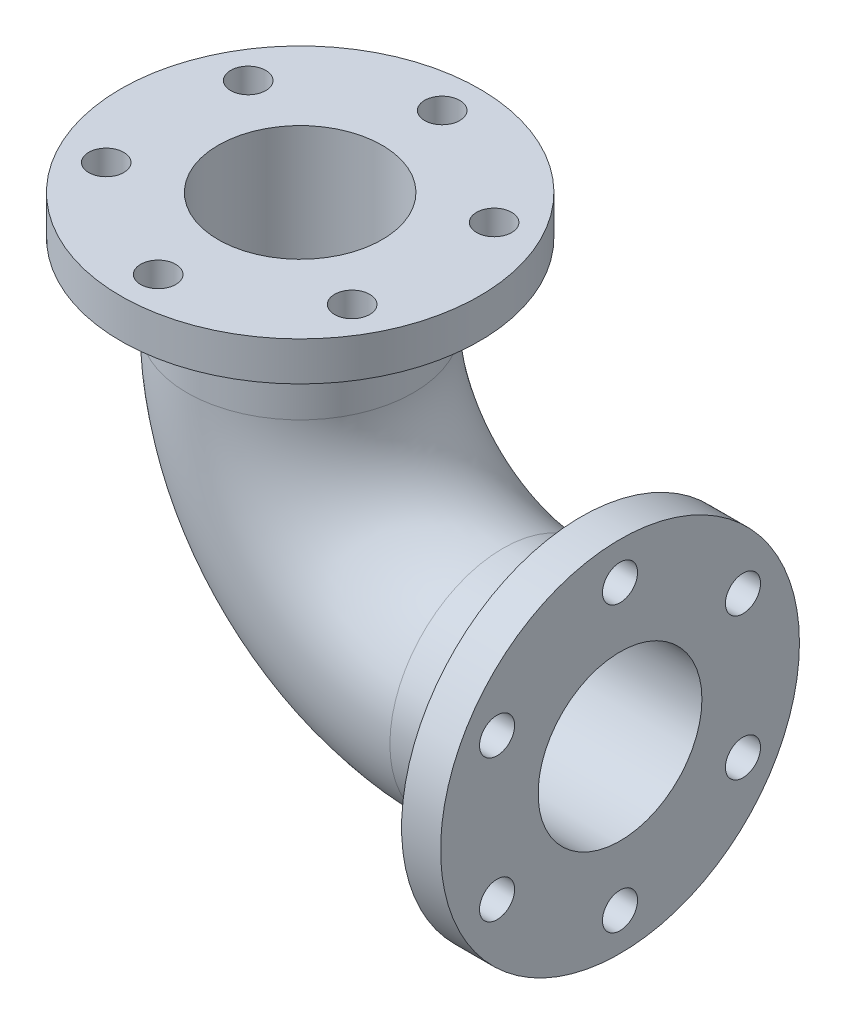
ISO-10303-21;
HEADER;
FILE_DESCRIPTION(('STEP AP214'),'2;1');
FILE_NAME('part.step','',(''),(''),'','','');
FILE_SCHEMA(('AUTOMOTIVE_DESIGN { 1 0 10303 214 1 1 1 1 }'));
ENDSEC;
DATA;
#1=APPLICATION_CONTEXT('core data for automotive mechanical design processes');
#2=APPLICATION_PROTOCOL_DEFINITION('international standard','automotive_design',2000,#1);
#3=PRODUCT_CONTEXT('',#1,'mechanical');
#4=PRODUCT('Part','Part','',(#3));
#5=PRODUCT_RELATED_PRODUCT_CATEGORY('part','',(#4));
#6=PRODUCT_DEFINITION_FORMATION('','',#4);
#7=PRODUCT_DEFINITION_CONTEXT('part definition',#1,'design');
#8=PRODUCT_DEFINITION('design','',#6,#7);
#9=PRODUCT_DEFINITION_SHAPE('','',#8);
#10=(LENGTH_UNIT() NAMED_UNIT(*) SI_UNIT(.MILLI.,.METRE.));
#11=(NAMED_UNIT(*) PLANE_ANGLE_UNIT() SI_UNIT($,.RADIAN.));
#12=(NAMED_UNIT(*) SI_UNIT($,.STERADIAN.) SOLID_ANGLE_UNIT());
#13=UNCERTAINTY_MEASURE_WITH_UNIT(LENGTH_MEASURE(1.E-05),#10,'distance_accuracy_value','');
#14=(GEOMETRIC_REPRESENTATION_CONTEXT(3) GLOBAL_UNCERTAINTY_ASSIGNED_CONTEXT((#13)) GLOBAL_UNIT_ASSIGNED_CONTEXT((#10,
#11,#12)) REPRESENTATION_CONTEXT('',''));
#15=CARTESIAN_POINT('',(0.,0.,0.));
#16=DIRECTION('',(0.,0.,1.));
#17=DIRECTION('',(1.,0.,0.));
#18=AXIS2_PLACEMENT_3D('',#15,#16,#17);
#19=CARTESIAN_POINT('',(0.,0.,0.));
#20=DIRECTION('',(0.,-1.,0.));
#21=DIRECTION('',(0.,0.,-1.));
#22=AXIS2_PLACEMENT_3D('',#19,#20,#21);
#23=CYLINDRICAL_SURFACE('',#22,145.);
#24=CARTESIAN_POINT('',(0.,-100.,0.));
#25=DIRECTION('',(0.,1.,0.));
#26=DIRECTION('',(0.,0.,1.));
#27=AXIS2_PLACEMENT_3D('',#24,#25,#26);
#28=CIRCLE('',#27,145.);
#29=CARTESIAN_POINT('',(-145.,-100.,0.));
#30=VERTEX_POINT('',#29);
#31=EDGE_CURVE('E56',#30,#30,#28,.T.);
#32=ORIENTED_EDGE('',*,*,#31,.T.);
#33=EDGE_LOOP('',(#32));
#34=FACE_BOUND('',#33,.T.);
#35=CARTESIAN_POINT('',(0.,0.,0.));
#36=DIRECTION('',(0.,1.,0.));
#37=DIRECTION('',(0.,0.,1.));
#38=AXIS2_PLACEMENT_3D('',#35,#36,#37);
#39=CIRCLE('',#38,145.);
#40=CARTESIAN_POINT('',(0.,0.,145.));
#41=VERTEX_POINT('',#40);
#42=EDGE_CURVE('E60',#41,#41,#39,.T.);
#43=ORIENTED_EDGE('',*,*,#42,.F.);
#44=EDGE_LOOP('',(#43));
#45=FACE_BOUND('',#44,.T.);
#46=ADVANCED_FACE('F48',(#34,#45),#23,.T.);
#47=CARTESIAN_POINT('',(260.,-100.,0.));
#48=DIRECTION('',(0.,0.,1.));
#49=DIRECTION('',(1.,0.,0.));
#50=AXIS2_PLACEMENT_3D('',#47,#48,#49);
#51=TOROIDAL_SURFACE('',#50,260.,145.);
#52=CARTESIAN_POINT('',(260.,-360.,0.));
#53=DIRECTION('',(-1.,0.,0.));
#54=DIRECTION('',(0.,0.,1.));
#55=AXIS2_PLACEMENT_3D('',#52,#53,#54);
#56=CIRCLE('',#55,145.);
#57=CARTESIAN_POINT('',(260.,-505.,0.));
#58=VERTEX_POINT('',#57);
#59=EDGE_CURVE('E11',#58,#58,#56,.T.);
#60=CARTESIAN_POINT('',(260.,-100.,0.));
#61=DIRECTION('',(0.,0.,1.));
#62=DIRECTION('',(1.,0.,0.));
#63=AXIS2_PLACEMENT_3D('',#60,#61,#62);
#64=CIRCLE('',#63,405.);
#65=EDGE_CURVE('',#30,#58,#64,.T.);
#66=ORIENTED_EDGE('',*,*,#31,.F.);
#67=ORIENTED_EDGE('',*,*,#59,.T.);
#68=ORIENTED_EDGE('',*,*,#65,.T.);
#69=ORIENTED_EDGE('',*,*,#65,.F.);
#70=EDGE_LOOP('',(#66,#68,#67,#69));
#71=FACE_BOUND('',#70,.T.);
#72=ADVANCED_FACE('F198',(#71),#51,.T.);
#73=CARTESIAN_POINT('',(260.,-360.,0.));
#74=DIRECTION('',(1.,0.,0.));
#75=DIRECTION('',(0.,1.,0.));
#76=AXIS2_PLACEMENT_3D('',#73,#74,#75);
#77=CYLINDRICAL_SURFACE('',#76,145.);
#78=CARTESIAN_POINT('',(360.,-360.,0.));
#79=DIRECTION('',(-1.,0.,0.));
#80=DIRECTION('',(0.,0.,1.));
#81=AXIS2_PLACEMENT_3D('',#78,#79,#80);
#82=CIRCLE('',#81,145.);
#83=CARTESIAN_POINT('',(360.,-360.,145.));
#84=VERTEX_POINT('',#83);
#85=EDGE_CURVE('E52',#84,#84,#82,.T.);
#86=ORIENTED_EDGE('',*,*,#85,.T.);
#87=EDGE_LOOP('',(#86));
#88=FACE_BOUND('',#87,.T.);
#89=ORIENTED_EDGE('',*,*,#59,.F.);
#90=EDGE_LOOP('',(#89));
#91=FACE_BOUND('',#90,.T.);
#92=ADVANCED_FACE('F50',(#88,#91),#77,.T.);
#93=CARTESIAN_POINT('',(0.,0.,0.));
#94=DIRECTION('',(0.,-1.,0.));
#95=DIRECTION('',(0.,0.,-1.));
#96=AXIS2_PLACEMENT_3D('',#93,#94,#95);
#97=CYLINDRICAL_SURFACE('',#96,105.);
#98=CARTESIAN_POINT('',(0.,-100.,0.));
#99=DIRECTION('',(0.,-1.,0.));
#100=DIRECTION('',(0.,0.,-1.));
#101=AXIS2_PLACEMENT_3D('',#98,#99,#100);
#102=CIRCLE('',#101,105.);
#103=CARTESIAN_POINT('',(-105.,-100.,0.));
#104=VERTEX_POINT('',#103);
#105=EDGE_CURVE('E68',#104,#104,#102,.F.);
#106=ORIENTED_EDGE('',*,*,#105,.F.);
#107=EDGE_LOOP('',(#106));
#108=FACE_BOUND('',#107,.T.);
#109=CARTESIAN_POINT('',(0.,50.,0.));
#110=DIRECTION('',(0.,1.,0.));
#111=DIRECTION('',(-1.,0.,0.));
#112=AXIS2_PLACEMENT_3D('',#109,#110,#111);
#113=CIRCLE('',#112,105.);
#114=CARTESIAN_POINT('',(-105.,50.,0.));
#115=VERTEX_POINT('',#114);
#116=EDGE_CURVE('E75',#115,#115,#113,.T.);
#117=ORIENTED_EDGE('',*,*,#116,.T.);
#118=EDGE_LOOP('',(#117));
#119=FACE_BOUND('',#118,.T.);
#120=ADVANCED_FACE('F193',(#108,#119),#97,.F.);
#121=CARTESIAN_POINT('',(260.,-100.,0.));
#122=DIRECTION('',(0.,0.,1.));
#123=DIRECTION('',(1.,0.,0.));
#124=AXIS2_PLACEMENT_3D('',#121,#122,#123);
#125=TOROIDAL_SURFACE('',#124,260.,105.);
#126=CARTESIAN_POINT('',(260.,-360.,0.));
#127=DIRECTION('',(-1.,0.,0.));
#128=DIRECTION('',(0.,-1.,0.));
#129=AXIS2_PLACEMENT_3D('',#126,#127,#128);
#130=CIRCLE('',#129,105.);
#131=CARTESIAN_POINT('',(260.,-465.,0.));
#132=VERTEX_POINT('',#131);
#133=EDGE_CURVE('E65',#132,#132,#130,.T.);
#134=CARTESIAN_POINT('',(260.,-100.,0.));
#135=DIRECTION('',(0.,0.,1.));
#136=DIRECTION('',(1.,0.,0.));
#137=AXIS2_PLACEMENT_3D('',#134,#135,#136);
#138=CIRCLE('',#137,365.);
#139=EDGE_CURVE('',#104,#132,#138,.T.);
#140=ORIENTED_EDGE('',*,*,#105,.T.);
#141=ORIENTED_EDGE('',*,*,#133,.F.);
#142=ORIENTED_EDGE('',*,*,#139,.T.);
#143=ORIENTED_EDGE('',*,*,#139,.F.);
#144=EDGE_LOOP('',(#140,#142,#141,#143));
#145=FACE_BOUND('',#144,.T.);
#146=ADVANCED_FACE('F183',(#145),#125,.F.);
#147=CARTESIAN_POINT('',(260.,-360.,0.));
#148=DIRECTION('',(1.,0.,0.));
#149=DIRECTION('',(0.,1.,0.));
#150=AXIS2_PLACEMENT_3D('',#147,#148,#149);
#151=CYLINDRICAL_SURFACE('',#150,105.);
#152=ORIENTED_EDGE('',*,*,#133,.T.);
#153=EDGE_LOOP('',(#152));
#154=FACE_BOUND('',#153,.T.);
#155=CARTESIAN_POINT('',(410.,-360.,0.));
#156=DIRECTION('',(1.,0.,0.));
#157=DIRECTION('',(0.,0.,-1.));
#158=AXIS2_PLACEMENT_3D('',#155,#156,#157);
#159=CIRCLE('',#158,105.);
#160=CARTESIAN_POINT('',(410.,-360.,-105.));
#161=VERTEX_POINT('',#160);
#162=EDGE_CURVE('E120',#161,#161,#159,.T.);
#163=ORIENTED_EDGE('',*,*,#162,.T.);
#164=EDGE_LOOP('',(#163));
#165=FACE_BOUND('',#164,.T.);
#166=ADVANCED_FACE('F180',(#154,#165),#151,.F.);
#167=CARTESIAN_POINT('',(0.,50.,0.));
#168=DIRECTION('',(0.,1.,0.));
#169=DIRECTION('',(-1.,0.,0.));
#170=AXIS2_PLACEMENT_3D('',#167,#168,#169);
#171=PLANE('',#170);
#172=CARTESIAN_POINT('',(157.616623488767,50.0000000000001,-91.0000000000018));
#173=DIRECTION('',(0.,1.,0.));
#174=DIRECTION('',(-0.50000000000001,0.,-0.866025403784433));
#175=AXIS2_PLACEMENT_3D('',#172,#173,#174);
#176=CIRCLE('',#175,22.5);
#177=CARTESIAN_POINT('',(146.366623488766,50.0000000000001,-110.485571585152));
#178=VERTEX_POINT('',#177);
#179=EDGE_CURVE('E97',#178,#178,#176,.T.);
#180=ORIENTED_EDGE('',*,*,#179,.F.);
#181=EDGE_LOOP('',(#180));
#182=FACE_BOUND('',#181,.T.);
#183=CARTESIAN_POINT('',(157.616623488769,50.0000000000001,90.9999999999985));
#184=DIRECTION('',(0.,1.,0.));
#185=DIRECTION('',(0.499999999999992,0.,-0.866025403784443));
#186=AXIS2_PLACEMENT_3D('',#183,#184,#185);
#187=CIRCLE('',#186,22.5);
#188=CARTESIAN_POINT('',(168.866623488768,50.0000000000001,71.5144284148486));
#189=VERTEX_POINT('',#188);
#190=EDGE_CURVE('E96',#189,#189,#187,.T.);
#191=ORIENTED_EDGE('',*,*,#190,.F.);
#192=EDGE_LOOP('',(#191));
#193=FACE_BOUND('',#192,.T.);
#194=CARTESIAN_POINT('',(0.,50.,182.));
#195=DIRECTION('',(0.,1.,0.));
#196=DIRECTION('',(1.,0.,0.));
#197=AXIS2_PLACEMENT_3D('',#194,#195,#196);
#198=CIRCLE('',#197,22.5);
#199=CARTESIAN_POINT('',(22.5,50.,182.));
#200=VERTEX_POINT('',#199);
#201=EDGE_CURVE('E103',#200,#200,#198,.T.);
#202=ORIENTED_EDGE('',*,*,#201,.F.);
#203=EDGE_LOOP('',(#202));
#204=FACE_BOUND('',#203,.T.);
#205=CARTESIAN_POINT('',(-157.616623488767,49.9999999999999,91.0000000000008));
#206=DIRECTION('',(0.,1.,0.));
#207=DIRECTION('',(0.500000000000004,0.,0.866025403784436));
#208=AXIS2_PLACEMENT_3D('',#205,#206,#207);
#209=CIRCLE('',#208,22.5);
#210=CARTESIAN_POINT('',(-146.366623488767,49.9999999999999,110.485571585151));
#211=VERTEX_POINT('',#210);
#212=EDGE_CURVE('E109',#211,#211,#209,.T.);
#213=ORIENTED_EDGE('',*,*,#212,.F.);
#214=EDGE_LOOP('',(#213));
#215=FACE_BOUND('',#214,.T.);
#216=CARTESIAN_POINT('',(-157.616623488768,49.9999999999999,-90.9999999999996));
#217=DIRECTION('',(0.,1.,0.));
#218=DIRECTION('',(-0.499999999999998,0.,0.86602540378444));
#219=AXIS2_PLACEMENT_3D('',#216,#217,#218);
#220=CIRCLE('',#219,22.5);
#221=CARTESIAN_POINT('',(-168.866623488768,49.9999999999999,-71.5144284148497));
#222=VERTEX_POINT('',#221);
#223=EDGE_CURVE('E89',#222,#222,#220,.T.);
#224=ORIENTED_EDGE('',*,*,#223,.F.);
#225=EDGE_LOOP('',(#224));
#226=FACE_BOUND('',#225,.T.);
#227=CARTESIAN_POINT('',(0.,50.,-182.));
#228=DIRECTION('',(0.,1.,0.));
#229=DIRECTION('',(-1.,0.,0.));
#230=AXIS2_PLACEMENT_3D('',#227,#228,#229);
#231=CIRCLE('',#230,22.5);
#232=CARTESIAN_POINT('',(-22.5,50.,-182.));
#233=VERTEX_POINT('',#232);
#234=EDGE_CURVE('E83',#233,#233,#231,.T.);
#235=ORIENTED_EDGE('',*,*,#234,.F.);
#236=EDGE_LOOP('',(#235));
#237=FACE_BOUND('',#236,.T.);
#238=CARTESIAN_POINT('',(0.,50.,0.));
#239=DIRECTION('',(0.,1.,0.));
#240=DIRECTION('',(-1.,0.,0.));
#241=AXIS2_PLACEMENT_3D('',#238,#239,#240);
#242=CIRCLE('',#241,230.);
#243=CARTESIAN_POINT('',(-230.,49.9999999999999,0.));
#244=VERTEX_POINT('',#243);
#245=EDGE_CURVE('E71',#244,#244,#242,.T.);
#246=ORIENTED_EDGE('',*,*,#245,.T.);
#247=EDGE_LOOP('',(#246));
#248=FACE_BOUND('',#247,.T.);
#249=ORIENTED_EDGE('',*,*,#116,.F.);
#250=EDGE_LOOP('',(#249));
#251=FACE_BOUND('',#250,.T.);
#252=ADVANCED_FACE('F182',(#182,#193,#204,#215,#226,#237,#248,#251),#171,.T.);
#253=CARTESIAN_POINT('',(0.,0.,0.));
#254=DIRECTION('',(0.,1.,0.));
#255=DIRECTION('',(-1.,0.,0.));
#256=AXIS2_PLACEMENT_3D('',#253,#254,#255);
#257=PLANE('',#256);
#258=CARTESIAN_POINT('',(157.616623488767,1.11022302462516E-13,-91.0000000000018));
#259=DIRECTION('',(0.,1.,0.));
#260=DIRECTION('',(-1.,0.,0.));
#261=AXIS2_PLACEMENT_3D('',#258,#259,#260);
#262=CIRCLE('',#261,22.5);
#263=CARTESIAN_POINT('',(135.116623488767,0.,-91.0000000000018));
#264=VERTEX_POINT('',#263);
#265=EDGE_CURVE('E93',#264,#264,#262,.F.);
#266=ORIENTED_EDGE('',*,*,#265,.F.);
#267=EDGE_LOOP('',(#266));
#268=FACE_BOUND('',#267,.T.);
#269=CARTESIAN_POINT('',(157.616623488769,1.11022302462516E-13,90.9999999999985));
#270=DIRECTION('',(0.,1.,0.));
#271=DIRECTION('',(-1.,0.,0.));
#272=AXIS2_PLACEMENT_3D('',#269,#270,#271);
#273=CIRCLE('',#272,22.5);
#274=CARTESIAN_POINT('',(135.116623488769,0.,90.9999999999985));
#275=VERTEX_POINT('',#274);
#276=EDGE_CURVE('E100',#275,#275,#273,.F.);
#277=ORIENTED_EDGE('',*,*,#276,.F.);
#278=EDGE_LOOP('',(#277));
#279=FACE_BOUND('',#278,.T.);
#280=CARTESIAN_POINT('',(0.,0.,182.));
#281=DIRECTION('',(0.,1.,0.));
#282=DIRECTION('',(-1.,0.,0.));
#283=AXIS2_PLACEMENT_3D('',#280,#281,#282);
#284=CIRCLE('',#283,22.5);
#285=CARTESIAN_POINT('',(-22.5,0.,182.));
#286=VERTEX_POINT('',#285);
#287=EDGE_CURVE('E106',#286,#286,#284,.F.);
#288=ORIENTED_EDGE('',*,*,#287,.F.);
#289=EDGE_LOOP('',(#288));
#290=FACE_BOUND('',#289,.T.);
#291=CARTESIAN_POINT('',(-157.616623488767,-1.11022302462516E-13,91.0000000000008));
#292=DIRECTION('',(0.,1.,0.));
#293=DIRECTION('',(-1.,0.,0.));
#294=AXIS2_PLACEMENT_3D('',#291,#292,#293);
#295=CIRCLE('',#294,22.5);
#296=CARTESIAN_POINT('',(-180.116623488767,-1.23512311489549E-13,91.0000000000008));
#297=VERTEX_POINT('',#296);
#298=EDGE_CURVE('E92',#297,#297,#295,.F.);
#299=ORIENTED_EDGE('',*,*,#298,.F.);
#300=EDGE_LOOP('',(#299));
#301=FACE_BOUND('',#300,.T.);
#302=CARTESIAN_POINT('',(-157.616623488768,-1.11022302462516E-13,-90.9999999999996));
#303=DIRECTION('',(0.,1.,0.));
#304=DIRECTION('',(-1.,0.,0.));
#305=AXIS2_PLACEMENT_3D('',#302,#303,#304);
#306=CIRCLE('',#305,22.5);
#307=CARTESIAN_POINT('',(-180.116623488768,-1.23512311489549E-13,-90.9999999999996));
#308=VERTEX_POINT('',#307);
#309=EDGE_CURVE('E86',#308,#308,#306,.F.);
#310=ORIENTED_EDGE('',*,*,#309,.F.);
#311=EDGE_LOOP('',(#310));
#312=FACE_BOUND('',#311,.T.);
#313=CARTESIAN_POINT('',(0.,0.,-182.));
#314=DIRECTION('',(0.,1.,0.));
#315=DIRECTION('',(-1.,0.,0.));
#316=AXIS2_PLACEMENT_3D('',#313,#314,#315);
#317=CIRCLE('',#316,22.5);
#318=CARTESIAN_POINT('',(-22.5,0.,-182.));
#319=VERTEX_POINT('',#318);
#320=EDGE_CURVE('E80',#319,#319,#317,.F.);
#321=ORIENTED_EDGE('',*,*,#320,.F.);
#322=EDGE_LOOP('',(#321));
#323=FACE_BOUND('',#322,.T.);
#324=ORIENTED_EDGE('',*,*,#42,.T.);
#325=EDGE_LOOP('',(#324));
#326=FACE_BOUND('',#325,.T.);
#327=CARTESIAN_POINT('',(0.,0.,0.));
#328=DIRECTION('',(0.,1.,0.));
#329=DIRECTION('',(-1.,0.,0.));
#330=AXIS2_PLACEMENT_3D('',#327,#328,#329);
#331=CIRCLE('',#330,230.);
#332=CARTESIAN_POINT('',(-230.,-1.27675647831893E-13,0.));
#333=VERTEX_POINT('',#332);
#334=EDGE_CURVE('E72',#333,#333,#331,.T.);
#335=ORIENTED_EDGE('',*,*,#334,.F.);
#336=EDGE_LOOP('',(#335));
#337=FACE_BOUND('',#336,.T.);
#338=ADVANCED_FACE('F190',(#268,#279,#290,#301,#312,#323,#326,#337),#257,.F.);
#339=CARTESIAN_POINT('',(0.,50.,0.));
#340=DIRECTION('',(0.,-1.,0.));
#341=DIRECTION('',(1.,0.,0.));
#342=AXIS2_PLACEMENT_3D('',#339,#340,#341);
#343=CYLINDRICAL_SURFACE('',#342,230.);
#344=ORIENTED_EDGE('',*,*,#245,.F.);
#345=EDGE_LOOP('',(#344));
#346=FACE_BOUND('',#345,.T.);
#347=ORIENTED_EDGE('',*,*,#334,.T.);
#348=EDGE_LOOP('',(#347));
#349=FACE_BOUND('',#348,.T.);
#350=ADVANCED_FACE('F251',(#346,#349),#343,.T.);
#351=CARTESIAN_POINT('',(2.80331868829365E-13,-505.001,-182.));
#352=DIRECTION('',(0.,1.,0.));
#353=DIRECTION('',(-1.,0.,0.));
#354=AXIS2_PLACEMENT_3D('',#351,#352,#353);
#355=CYLINDRICAL_SURFACE('',#354,22.5);
#356=ORIENTED_EDGE('',*,*,#234,.T.);
#357=EDGE_LOOP('',(#356));
#358=FACE_BOUND('',#357,.T.);
#359=ORIENTED_EDGE('',*,*,#320,.T.);
#360=EDGE_LOOP('',(#359));
#361=FACE_BOUND('',#360,.T.);
#362=ADVANCED_FACE('F248',(#358,#361),#355,.F.);
#363=CARTESIAN_POINT('',(-157.616623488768,-505.001,-90.9999999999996));
#364=DIRECTION('',(0.,1.,0.));
#365=DIRECTION('',(-1.,0.,0.));
#366=AXIS2_PLACEMENT_3D('',#363,#364,#365);
#367=CYLINDRICAL_SURFACE('',#366,22.5);
#368=ORIENTED_EDGE('',*,*,#223,.T.);
#369=EDGE_LOOP('',(#368));
#370=FACE_BOUND('',#369,.T.);
#371=ORIENTED_EDGE('',*,*,#309,.T.);
#372=EDGE_LOOP('',(#371));
#373=FACE_BOUND('',#372,.T.);
#374=ADVANCED_FACE('F234',(#370,#373),#367,.F.);
#375=CARTESIAN_POINT('',(-157.616623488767,-505.001,91.0000000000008));
#376=DIRECTION('',(0.,1.,0.));
#377=DIRECTION('',(-1.,0.,0.));
#378=AXIS2_PLACEMENT_3D('',#375,#376,#377);
#379=CYLINDRICAL_SURFACE('',#378,22.5);
#380=ORIENTED_EDGE('',*,*,#212,.T.);
#381=EDGE_LOOP('',(#380));
#382=FACE_BOUND('',#381,.T.);
#383=ORIENTED_EDGE('',*,*,#298,.T.);
#384=EDGE_LOOP('',(#383));
#385=FACE_BOUND('',#384,.T.);
#386=ADVANCED_FACE('F230',(#382,#385),#379,.F.);
#387=CARTESIAN_POINT('',(2.80331868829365E-13,-505.001,182.));
#388=DIRECTION('',(0.,1.,0.));
#389=DIRECTION('',(-1.,0.,0.));
#390=AXIS2_PLACEMENT_3D('',#387,#388,#389);
#391=CYLINDRICAL_SURFACE('',#390,22.5);
#392=ORIENTED_EDGE('',*,*,#201,.T.);
#393=EDGE_LOOP('',(#392));
#394=FACE_BOUND('',#393,.T.);
#395=ORIENTED_EDGE('',*,*,#287,.T.);
#396=EDGE_LOOP('',(#395));
#397=FACE_BOUND('',#396,.T.);
#398=ADVANCED_FACE('F233',(#394,#397),#391,.F.);
#399=CARTESIAN_POINT('',(157.616623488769,-505.001,90.9999999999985));
#400=DIRECTION('',(0.,1.,0.));
#401=DIRECTION('',(-1.,0.,0.));
#402=AXIS2_PLACEMENT_3D('',#399,#400,#401);
#403=CYLINDRICAL_SURFACE('',#402,22.5);
#404=ORIENTED_EDGE('',*,*,#190,.T.);
#405=EDGE_LOOP('',(#404));
#406=FACE_BOUND('',#405,.T.);
#407=ORIENTED_EDGE('',*,*,#276,.T.);
#408=EDGE_LOOP('',(#407));
#409=FACE_BOUND('',#408,.T.);
#410=ADVANCED_FACE('F238',(#406,#409),#403,.F.);
#411=CARTESIAN_POINT('',(157.616623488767,-505.001,-91.0000000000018));
#412=DIRECTION('',(0.,1.,0.));
#413=DIRECTION('',(-1.,0.,0.));
#414=AXIS2_PLACEMENT_3D('',#411,#412,#413);
#415=CYLINDRICAL_SURFACE('',#414,22.5);
#416=ORIENTED_EDGE('',*,*,#179,.T.);
#417=EDGE_LOOP('',(#416));
#418=FACE_BOUND('',#417,.T.);
#419=ORIENTED_EDGE('',*,*,#265,.T.);
#420=EDGE_LOOP('',(#419));
#421=FACE_BOUND('',#420,.T.);
#422=ADVANCED_FACE('F169',(#418,#421),#415,.F.);
#423=CARTESIAN_POINT('',(410.,-360.,0.));
#424=DIRECTION('',(1.,0.,0.));
#425=DIRECTION('',(0.,0.,-1.));
#426=AXIS2_PLACEMENT_3D('',#423,#424,#425);
#427=PLANE('',#426);
#428=CARTESIAN_POINT('',(410.,-451.000000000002,157.616623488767));
#429=DIRECTION('',(1.,0.,0.));
#430=DIRECTION('',(0.,-0.866025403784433,-0.50000000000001));
#431=AXIS2_PLACEMENT_3D('',#428,#429,#430);
#432=CIRCLE('',#431,22.5);
#433=CARTESIAN_POINT('',(410.,-470.485571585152,146.366623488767));
#434=VERTEX_POINT('',#433);
#435=EDGE_CURVE('E142',#434,#434,#432,.T.);
#436=ORIENTED_EDGE('',*,*,#435,.F.);
#437=EDGE_LOOP('',(#436));
#438=FACE_BOUND('',#437,.T.);
#439=CARTESIAN_POINT('',(410.,-269.000000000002,157.616623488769));
#440=DIRECTION('',(1.,0.,0.));
#441=DIRECTION('',(0.,-0.866025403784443,0.499999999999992));
#442=AXIS2_PLACEMENT_3D('',#439,#440,#441);
#443=CIRCLE('',#442,22.5);
#444=CARTESIAN_POINT('',(410.,-288.485571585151,168.866623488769));
#445=VERTEX_POINT('',#444);
#446=EDGE_CURVE('E141',#445,#445,#443,.T.);
#447=ORIENTED_EDGE('',*,*,#446,.F.);
#448=EDGE_LOOP('',(#447));
#449=FACE_BOUND('',#448,.T.);
#450=CARTESIAN_POINT('',(410.,-178.,0.));
#451=DIRECTION('',(1.,0.,0.));
#452=DIRECTION('',(0.,0.,1.));
#453=AXIS2_PLACEMENT_3D('',#450,#451,#452);
#454=CIRCLE('',#453,22.5);
#455=CARTESIAN_POINT('',(410.,-178.,22.5));
#456=VERTEX_POINT('',#455);
#457=EDGE_CURVE('E151',#456,#456,#454,.T.);
#458=ORIENTED_EDGE('',*,*,#457,.F.);
#459=EDGE_LOOP('',(#458));
#460=FACE_BOUND('',#459,.T.);
#461=CARTESIAN_POINT('',(410.,-268.999999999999,-157.616623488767));
#462=DIRECTION('',(1.,0.,0.));
#463=DIRECTION('',(0.,0.866025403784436,0.500000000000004));
#464=AXIS2_PLACEMENT_3D('',#461,#462,#463);
#465=CIRCLE('',#464,22.5);
#466=CARTESIAN_POINT('',(410.,-249.514428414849,-146.366623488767));
#467=VERTEX_POINT('',#466);
#468=EDGE_CURVE('E154',#467,#467,#465,.T.);
#469=ORIENTED_EDGE('',*,*,#468,.F.);
#470=EDGE_LOOP('',(#469));
#471=FACE_BOUND('',#470,.T.);
#472=CARTESIAN_POINT('',(410.,-451.,-157.616623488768));
#473=DIRECTION('',(1.,0.,0.));
#474=DIRECTION('',(0.,0.86602540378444,-0.499999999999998));
#475=AXIS2_PLACEMENT_3D('',#472,#473,#474);
#476=CIRCLE('',#475,22.5);
#477=CARTESIAN_POINT('',(410.,-431.51442841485,-168.866623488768));
#478=VERTEX_POINT('',#477);
#479=EDGE_CURVE('E134',#478,#478,#476,.T.);
#480=ORIENTED_EDGE('',*,*,#479,.F.);
#481=EDGE_LOOP('',(#480));
#482=FACE_BOUND('',#481,.T.);
#483=CARTESIAN_POINT('',(410.,-542.,0.));
#484=DIRECTION('',(1.,0.,0.));
#485=DIRECTION('',(0.,0.,-1.));
#486=AXIS2_PLACEMENT_3D('',#483,#484,#485);
#487=CIRCLE('',#486,22.5);
#488=CARTESIAN_POINT('',(410.,-542.,-22.5));
#489=VERTEX_POINT('',#488);
#490=EDGE_CURVE('E128',#489,#489,#487,.T.);
#491=ORIENTED_EDGE('',*,*,#490,.F.);
#492=EDGE_LOOP('',(#491));
#493=FACE_BOUND('',#492,.T.);
#494=CARTESIAN_POINT('',(410.,-360.,0.));
#495=DIRECTION('',(1.,0.,0.));
#496=DIRECTION('',(0.,0.,-1.));
#497=AXIS2_PLACEMENT_3D('',#494,#495,#496);
#498=CIRCLE('',#497,230.);
#499=CARTESIAN_POINT('',(410.,-360.,-230.));
#500=VERTEX_POINT('',#499);
#501=EDGE_CURVE('E119',#500,#500,#498,.T.);
#502=ORIENTED_EDGE('',*,*,#501,.T.);
#503=EDGE_LOOP('',(#502));
#504=FACE_BOUND('',#503,.T.);
#505=ORIENTED_EDGE('',*,*,#162,.F.);
#506=EDGE_LOOP('',(#505));
#507=FACE_BOUND('',#506,.T.);
#508=ADVANCED_FACE('F165',(#438,#449,#460,#471,#482,#493,#504,#507),#427,.T.);
#509=CARTESIAN_POINT('',(360.,-360.,0.));
#510=DIRECTION('',(1.,0.,0.));
#511=DIRECTION('',(0.,0.,-1.));
#512=AXIS2_PLACEMENT_3D('',#509,#510,#511);
#513=PLANE('',#512);
#514=CARTESIAN_POINT('',(360.,-451.000000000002,157.616623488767));
#515=DIRECTION('',(1.,0.,0.));
#516=DIRECTION('',(0.,0.,-1.));
#517=AXIS2_PLACEMENT_3D('',#514,#515,#516);
#518=CIRCLE('',#517,22.5);
#519=CARTESIAN_POINT('',(360.,-451.000000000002,135.116623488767));
#520=VERTEX_POINT('',#519);
#521=EDGE_CURVE('E138',#520,#520,#518,.F.);
#522=ORIENTED_EDGE('',*,*,#521,.F.);
#523=EDGE_LOOP('',(#522));
#524=FACE_BOUND('',#523,.T.);
#525=CARTESIAN_POINT('',(360.,-269.000000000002,157.616623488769));
#526=DIRECTION('',(1.,0.,0.));
#527=DIRECTION('',(0.,0.,-1.));
#528=AXIS2_PLACEMENT_3D('',#525,#526,#527);
#529=CIRCLE('',#528,22.5);
#530=CARTESIAN_POINT('',(360.,-269.000000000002,135.116623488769));
#531=VERTEX_POINT('',#530);
#532=EDGE_CURVE('E145',#531,#531,#529,.F.);
#533=ORIENTED_EDGE('',*,*,#532,.F.);
#534=EDGE_LOOP('',(#533));
#535=FACE_BOUND('',#534,.T.);
#536=CARTESIAN_POINT('',(360.,-178.,0.));
#537=DIRECTION('',(1.,0.,0.));
#538=DIRECTION('',(0.,0.,-1.));
#539=AXIS2_PLACEMENT_3D('',#536,#537,#538);
#540=CIRCLE('',#539,22.5);
#541=CARTESIAN_POINT('',(360.,-178.,-22.5));
#542=VERTEX_POINT('',#541);
#543=EDGE_CURVE('E148',#542,#542,#540,.F.);
#544=ORIENTED_EDGE('',*,*,#543,.F.);
#545=EDGE_LOOP('',(#544));
#546=FACE_BOUND('',#545,.T.);
#547=CARTESIAN_POINT('',(360.,-268.999999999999,-157.616623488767));
#548=DIRECTION('',(1.,0.,0.));
#549=DIRECTION('',(0.,0.,-1.));
#550=AXIS2_PLACEMENT_3D('',#547,#548,#549);
#551=CIRCLE('',#550,22.5);
#552=CARTESIAN_POINT('',(360.,-268.999999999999,-180.116623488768));
#553=VERTEX_POINT('',#552);
#554=EDGE_CURVE('E137',#553,#553,#551,.F.);
#555=ORIENTED_EDGE('',*,*,#554,.F.);
#556=EDGE_LOOP('',(#555));
#557=FACE_BOUND('',#556,.T.);
#558=CARTESIAN_POINT('',(360.,-451.,-157.616623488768));
#559=DIRECTION('',(1.,0.,0.));
#560=DIRECTION('',(0.,0.,-1.));
#561=AXIS2_PLACEMENT_3D('',#558,#559,#560);
#562=CIRCLE('',#561,22.5);
#563=CARTESIAN_POINT('',(360.,-451.,-180.116623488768));
#564=VERTEX_POINT('',#563);
#565=EDGE_CURVE('E131',#564,#564,#562,.F.);
#566=ORIENTED_EDGE('',*,*,#565,.F.);
#567=EDGE_LOOP('',(#566));
#568=FACE_BOUND('',#567,.T.);
#569=CARTESIAN_POINT('',(360.,-542.,0.));
#570=DIRECTION('',(1.,0.,0.));
#571=DIRECTION('',(0.,0.,-1.));
#572=AXIS2_PLACEMENT_3D('',#569,#570,#571);
#573=CIRCLE('',#572,22.5);
#574=CARTESIAN_POINT('',(360.,-542.,-22.5));
#575=VERTEX_POINT('',#574);
#576=EDGE_CURVE('E125',#575,#575,#573,.F.);
#577=ORIENTED_EDGE('',*,*,#576,.F.);
#578=EDGE_LOOP('',(#577));
#579=FACE_BOUND('',#578,.T.);
#580=ORIENTED_EDGE('',*,*,#85,.F.);
#581=EDGE_LOOP('',(#580));
#582=FACE_BOUND('',#581,.T.);
#583=CARTESIAN_POINT('',(360.,-360.,0.));
#584=DIRECTION('',(1.,0.,0.));
#585=DIRECTION('',(0.,0.,-1.));
#586=AXIS2_PLACEMENT_3D('',#583,#584,#585);
#587=CIRCLE('',#586,230.);
#588=CARTESIAN_POINT('',(360.,-360.,-230.));
#589=VERTEX_POINT('',#588);
#590=EDGE_CURVE('E116',#589,#589,#587,.T.);
#591=ORIENTED_EDGE('',*,*,#590,.F.);
#592=EDGE_LOOP('',(#591));
#593=FACE_BOUND('',#592,.T.);
#594=ADVANCED_FACE('F168',(#524,#535,#546,#557,#568,#579,#582,#593),#513,.F.);
#595=CARTESIAN_POINT('',(410.,-360.,0.));
#596=DIRECTION('',(-1.,0.,0.));
#597=DIRECTION('',(0.,0.,1.));
#598=AXIS2_PLACEMENT_3D('',#595,#596,#597);
#599=CYLINDRICAL_SURFACE('',#598,230.);
#600=ORIENTED_EDGE('',*,*,#501,.F.);
#601=EDGE_LOOP('',(#600));
#602=FACE_BOUND('',#601,.T.);
#603=ORIENTED_EDGE('',*,*,#590,.T.);
#604=EDGE_LOOP('',(#603));
#605=FACE_BOUND('',#604,.T.);
#606=ADVANCED_FACE('F214',(#602,#605),#599,.T.);
#607=CARTESIAN_POINT('',(-230.001,-542.,0.));
#608=DIRECTION('',(1.,0.,0.));
#609=DIRECTION('',(0.,0.,-1.));
#610=AXIS2_PLACEMENT_3D('',#607,#608,#609);
#611=CYLINDRICAL_SURFACE('',#610,22.5);
#612=ORIENTED_EDGE('',*,*,#490,.T.);
#613=EDGE_LOOP('',(#612));
#614=FACE_BOUND('',#613,.T.);
#615=ORIENTED_EDGE('',*,*,#576,.T.);
#616=EDGE_LOOP('',(#615));
#617=FACE_BOUND('',#616,.T.);
#618=ADVANCED_FACE('F220',(#614,#617),#611,.F.);
#619=CARTESIAN_POINT('',(-230.001,-451.,-157.616623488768));
#620=DIRECTION('',(1.,0.,0.));
#621=DIRECTION('',(0.,0.,-1.));
#622=AXIS2_PLACEMENT_3D('',#619,#620,#621);
#623=CYLINDRICAL_SURFACE('',#622,22.5);
#624=ORIENTED_EDGE('',*,*,#479,.T.);
#625=EDGE_LOOP('',(#624));
#626=FACE_BOUND('',#625,.T.);
#627=ORIENTED_EDGE('',*,*,#565,.T.);
#628=EDGE_LOOP('',(#627));
#629=FACE_BOUND('',#628,.T.);
#630=ADVANCED_FACE('F226',(#626,#629),#623,.F.);
#631=CARTESIAN_POINT('',(-230.001,-268.999999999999,-157.616623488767));
#632=DIRECTION('',(1.,0.,0.));
#633=DIRECTION('',(0.,0.,-1.));
#634=AXIS2_PLACEMENT_3D('',#631,#632,#633);
#635=CYLINDRICAL_SURFACE('',#634,22.5);
#636=ORIENTED_EDGE('',*,*,#468,.T.);
#637=EDGE_LOOP('',(#636));
#638=FACE_BOUND('',#637,.T.);
#639=ORIENTED_EDGE('',*,*,#554,.T.);
#640=EDGE_LOOP('',(#639));
#641=FACE_BOUND('',#640,.T.);
#642=ADVANCED_FACE('F162',(#638,#641),#635,.F.);
#643=CARTESIAN_POINT('',(-230.001,-178.,0.));
#644=DIRECTION('',(1.,0.,0.));
#645=DIRECTION('',(0.,0.,-1.));
#646=AXIS2_PLACEMENT_3D('',#643,#644,#645);
#647=CYLINDRICAL_SURFACE('',#646,22.5);
#648=ORIENTED_EDGE('',*,*,#457,.T.);
#649=EDGE_LOOP('',(#648));
#650=FACE_BOUND('',#649,.T.);
#651=ORIENTED_EDGE('',*,*,#543,.T.);
#652=EDGE_LOOP('',(#651));
#653=FACE_BOUND('',#652,.T.);
#654=ADVANCED_FACE('F326',(#650,#653),#647,.F.);
#655=CARTESIAN_POINT('',(-230.001,-269.000000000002,157.616623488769));
#656=DIRECTION('',(1.,0.,0.));
#657=DIRECTION('',(0.,0.,-1.));
#658=AXIS2_PLACEMENT_3D('',#655,#656,#657);
#659=CYLINDRICAL_SURFACE('',#658,22.5);
#660=ORIENTED_EDGE('',*,*,#446,.T.);
#661=EDGE_LOOP('',(#660));
#662=FACE_BOUND('',#661,.T.);
#663=ORIENTED_EDGE('',*,*,#532,.T.);
#664=EDGE_LOOP('',(#663));
#665=FACE_BOUND('',#664,.T.);
#666=ADVANCED_FACE('F335',(#662,#665),#659,.F.);
#667=CARTESIAN_POINT('',(-230.001,-451.000000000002,157.616623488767));
#668=DIRECTION('',(1.,0.,0.));
#669=DIRECTION('',(0.,0.,-1.));
#670=AXIS2_PLACEMENT_3D('',#667,#668,#669);
#671=CYLINDRICAL_SURFACE('',#670,22.5);
#672=ORIENTED_EDGE('',*,*,#435,.T.);
#673=EDGE_LOOP('',(#672));
#674=FACE_BOUND('',#673,.T.);
#675=ORIENTED_EDGE('',*,*,#521,.T.);
#676=EDGE_LOOP('',(#675));
#677=FACE_BOUND('',#676,.T.);
#678=ADVANCED_FACE('F345',(#674,#677),#671,.F.);
#679=CLOSED_SHELL('',(#46,#72,#92,#120,#146,#166,#252,#338,#350,#362,#374,#386,#398,#410,#422,
#508,#594,#606,#618,#630,#642,#654,#666,#678));
#680=MANIFOLD_SOLID_BREP('B2',#679);
#681=ADVANCED_BREP_SHAPE_REPRESENTATION('',(#18,#680),#14);
#682=SHAPE_DEFINITION_REPRESENTATION(#9,#681);
ENDSEC;
END-ISO-10303-21;
